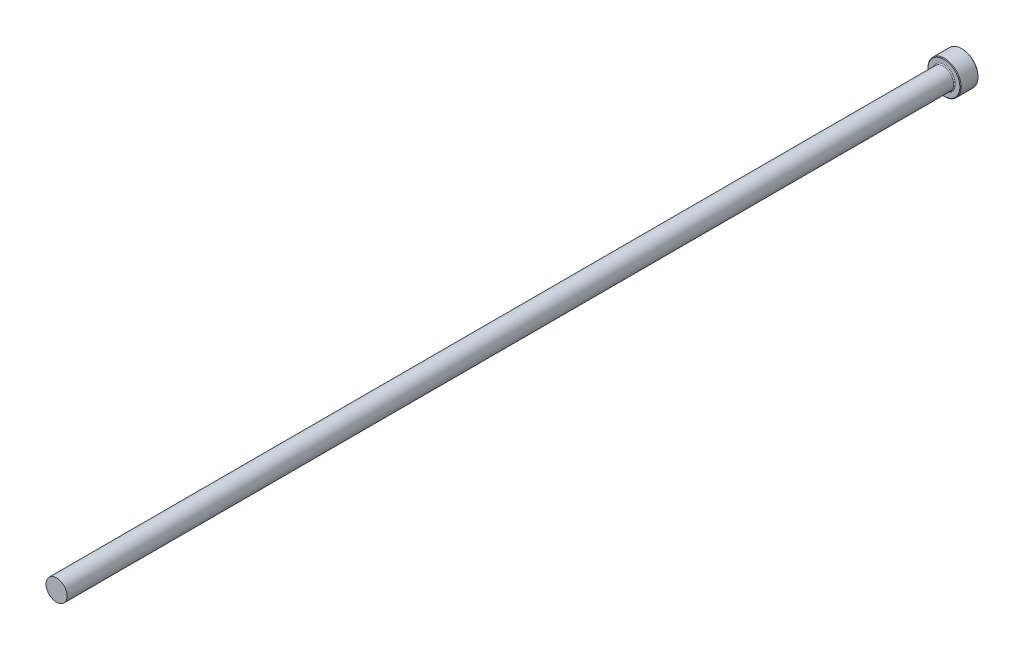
ISO-10303-21;
HEADER;
FILE_DESCRIPTION(('STEP AP214'),'2;1');
FILE_NAME('part.step','',(''),(''),'','','');
FILE_SCHEMA(('AUTOMOTIVE_DESIGN { 1 0 10303 214 1 1 1 1 }'));
ENDSEC;
DATA;
#1=APPLICATION_CONTEXT('core data for automotive mechanical design processes');
#2=APPLICATION_PROTOCOL_DEFINITION('international standard','automotive_design',2000,#1);
#3=PRODUCT_CONTEXT('',#1,'mechanical');
#4=PRODUCT('Part','Part','',(#3));
#5=PRODUCT_RELATED_PRODUCT_CATEGORY('part','',(#4));
#6=PRODUCT_DEFINITION_FORMATION('','',#4);
#7=PRODUCT_DEFINITION_CONTEXT('part definition',#1,'design');
#8=PRODUCT_DEFINITION('design','',#6,#7);
#9=PRODUCT_DEFINITION_SHAPE('','',#8);
#10=(LENGTH_UNIT() NAMED_UNIT(*) SI_UNIT(.MILLI.,.METRE.));
#11=(NAMED_UNIT(*) PLANE_ANGLE_UNIT() SI_UNIT($,.RADIAN.));
#12=(NAMED_UNIT(*) SI_UNIT($,.STERADIAN.) SOLID_ANGLE_UNIT());
#13=UNCERTAINTY_MEASURE_WITH_UNIT(LENGTH_MEASURE(1.E-05),#10,'distance_accuracy_value','');
#14=(GEOMETRIC_REPRESENTATION_CONTEXT(3) GLOBAL_UNCERTAINTY_ASSIGNED_CONTEXT((#13)) GLOBAL_UNIT_ASSIGNED_CONTEXT((#10,
#11,#12)) REPRESENTATION_CONTEXT('',''));
#15=CARTESIAN_POINT('',(0.,0.,0.));
#16=DIRECTION('',(0.,0.,1.));
#17=DIRECTION('',(1.,0.,0.));
#18=AXIS2_PLACEMENT_3D('',#15,#16,#17);
#19=CARTESIAN_POINT('',(0.,3.49999999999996,300.));
#20=DIRECTION('',(0.,0.,-1.));
#21=DIRECTION('',(-1.,0.,0.));
#22=AXIS2_PLACEMENT_3D('',#19,#20,#21);
#23=PLANE('',#22);
#24=CARTESIAN_POINT('',(0.,0.,300.));
#25=DIRECTION('',(0.,0.,1.));
#26=DIRECTION('',(1.,0.,0.));
#27=AXIS2_PLACEMENT_3D('',#24,#25,#26);
#28=CIRCLE('',#27,3.49999999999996);
#29=CARTESIAN_POINT('',(3.49999999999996,0.,300.));
#30=VERTEX_POINT('',#29);
#31=EDGE_CURVE('E50',#30,#30,#28,.T.);
#32=ORIENTED_EDGE('',*,*,#31,.T.);
#33=EDGE_LOOP('',(#32));
#34=FACE_BOUND('',#33,.T.);
#35=ADVANCED_FACE('F30',(#34),#23,.F.);
#36=CARTESIAN_POINT('',(0.,0.,109.050628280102));
#37=DIRECTION('',(0.,0.,1.));
#38=DIRECTION('',(1.,0.,0.));
#39=AXIS2_PLACEMENT_3D('',#36,#37,#38);
#40=CYLINDRICAL_SURFACE('',#39,3.49999999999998);
#41=ORIENTED_EDGE('',*,*,#31,.F.);
#42=EDGE_LOOP('',(#41));
#43=FACE_BOUND('',#42,.T.);
#44=CARTESIAN_POINT('',(0.,0.,6.3));
#45=DIRECTION('',(0.,0.,1.));
#46=DIRECTION('',(1.,0.,0.));
#47=AXIS2_PLACEMENT_3D('',#44,#45,#46);
#48=CIRCLE('',#47,3.5);
#49=CARTESIAN_POINT('',(3.5,0.,6.3));
#50=VERTEX_POINT('',#49);
#51=EDGE_CURVE('E53',#50,#50,#48,.T.);
#52=ORIENTED_EDGE('',*,*,#51,.T.);
#53=EDGE_LOOP('',(#52));
#54=FACE_BOUND('',#53,.T.);
#55=ADVANCED_FACE('F73',(#43,#54),#40,.T.);
#56=CARTESIAN_POINT('',(0.,0.,6.3));
#57=DIRECTION('',(0.,0.,1.));
#58=DIRECTION('',(1.,0.,0.));
#59=AXIS2_PLACEMENT_3D('',#56,#57,#58);
#60=TOROIDAL_SURFACE('',#59,3.8,0.3);
#61=ORIENTED_EDGE('',*,*,#51,.F.);
#62=EDGE_LOOP('',(#61));
#63=FACE_BOUND('',#62,.T.);
#64=CARTESIAN_POINT('',(0.,0.,6.00000000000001));
#65=DIRECTION('',(0.,0.,1.));
#66=DIRECTION('',(1.,0.,0.));
#67=AXIS2_PLACEMENT_3D('',#64,#65,#66);
#68=CIRCLE('',#67,3.8);
#69=CARTESIAN_POINT('',(3.8,0.,6.00000000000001));
#70=VERTEX_POINT('',#69);
#71=EDGE_CURVE('E56',#70,#70,#68,.T.);
#72=ORIENTED_EDGE('',*,*,#71,.T.);
#73=EDGE_LOOP('',(#72));
#74=FACE_BOUND('',#73,.T.);
#75=ADVANCED_FACE('F60',(#63,#74),#60,.F.);
#76=CARTESIAN_POINT('',(0.,5.5,6.));
#77=DIRECTION('',(0.,0.,-1.));
#78=DIRECTION('',(-1.,0.,0.));
#79=AXIS2_PLACEMENT_3D('',#76,#77,#78);
#80=PLANE('',#79);
#81=CARTESIAN_POINT('',(0.,0.,6.));
#82=DIRECTION('',(0.,0.,-1.));
#83=DIRECTION('',(-1.,0.,0.));
#84=AXIS2_PLACEMENT_3D('',#81,#82,#83);
#85=CIRCLE('',#84,5.30000000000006);
#86=CARTESIAN_POINT('',(-5.30000000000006,0.,6.));
#87=VERTEX_POINT('',#86);
#88=EDGE_CURVE('E10',#87,#87,#85,.F.);
#89=ORIENTED_EDGE('',*,*,#88,.T.);
#90=EDGE_LOOP('',(#89));
#91=FACE_BOUND('',#90,.T.);
#92=ORIENTED_EDGE('',*,*,#71,.F.);
#93=EDGE_LOOP('',(#92));
#94=FACE_BOUND('',#93,.T.);
#95=ADVANCED_FACE('F62',(#91,#94),#80,.F.);
#96=CARTESIAN_POINT('',(0.,0.,109.050628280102));
#97=DIRECTION('',(0.,0.,1.));
#98=DIRECTION('',(1.,0.,0.));
#99=AXIS2_PLACEMENT_3D('',#96,#97,#98);
#100=CYLINDRICAL_SURFACE('',#99,5.5);
#101=CARTESIAN_POINT('',(0.,0.,0.200000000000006));
#102=DIRECTION('',(0.,0.,1.));
#103=DIRECTION('',(1.,0.,0.));
#104=AXIS2_PLACEMENT_3D('',#101,#102,#103);
#105=CIRCLE('',#104,5.5);
#106=CARTESIAN_POINT('',(5.5,0.,0.200000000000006));
#107=VERTEX_POINT('',#106);
#108=EDGE_CURVE('E41',#107,#107,#105,.T.);
#109=ORIENTED_EDGE('',*,*,#108,.T.);
#110=EDGE_LOOP('',(#109));
#111=FACE_BOUND('',#110,.T.);
#112=CARTESIAN_POINT('',(0.,0.,5.80000000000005));
#113=DIRECTION('',(0.,0.,-1.));
#114=DIRECTION('',(-1.,0.,0.));
#115=AXIS2_PLACEMENT_3D('',#112,#113,#114);
#116=CIRCLE('',#115,5.5);
#117=CARTESIAN_POINT('',(-5.5,0.,5.80000000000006));
#118=VERTEX_POINT('',#117);
#119=EDGE_CURVE('E45',#118,#118,#116,.T.);
#120=ORIENTED_EDGE('',*,*,#119,.T.);
#121=EDGE_LOOP('',(#120));
#122=FACE_BOUND('',#121,.T.);
#123=ADVANCED_FACE('F64',(#111,#122),#100,.T.);
#124=CARTESIAN_POINT('',(0.,0.,0.));
#125=DIRECTION('',(0.,0.,1.));
#126=DIRECTION('',(1.,0.,0.));
#127=AXIS2_PLACEMENT_3D('',#124,#125,#126);
#128=PLANE('',#127);
#129=CARTESIAN_POINT('',(0.,0.,0.));
#130=DIRECTION('',(0.,0.,1.));
#131=DIRECTION('',(1.,0.,0.));
#132=AXIS2_PLACEMENT_3D('',#129,#130,#131);
#133=CIRCLE('',#132,5.3);
#134=CARTESIAN_POINT('',(5.3,0.,0.));
#135=VERTEX_POINT('',#134);
#136=EDGE_CURVE('E37',#135,#135,#133,.F.);
#137=ORIENTED_EDGE('',*,*,#136,.T.);
#138=EDGE_LOOP('',(#137));
#139=FACE_BOUND('',#138,.T.);
#140=ADVANCED_FACE('F70',(#139),#128,.F.);
#141=CARTESIAN_POINT('',(0.,0.,0.200000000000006));
#142=DIRECTION('',(0.,0.,1.));
#143=DIRECTION('',(1.,0.,0.));
#144=AXIS2_PLACEMENT_3D('',#141,#142,#143);
#145=CONICAL_SURFACE('',#144,5.5,0.785398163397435);
#146=ORIENTED_EDGE('',*,*,#136,.F.);
#147=EDGE_LOOP('',(#146));
#148=FACE_BOUND('',#147,.T.);
#149=ORIENTED_EDGE('',*,*,#108,.F.);
#150=EDGE_LOOP('',(#149));
#151=FACE_BOUND('',#150,.T.);
#152=ADVANCED_FACE('F84',(#148,#151),#145,.T.);
#153=CARTESIAN_POINT('',(0.,0.,6.00000000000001));
#154=DIRECTION('',(0.,0.,-1.));
#155=DIRECTION('',(-1.,0.,0.));
#156=AXIS2_PLACEMENT_3D('',#153,#154,#155);
#157=CONICAL_SURFACE('',#156,5.30000000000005,0.785398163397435);
#158=CARTESIAN_POINT('',(-5.5,0.,5.80000000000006));
#159=CARTESIAN_POINT('',(-5.49791666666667,0.,5.80208333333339));
#160=CARTESIAN_POINT('',(-5.49583333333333,0.,5.80416666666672));
#161=CARTESIAN_POINT('',(-5.49166666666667,0.,5.80833333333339));
#162=CARTESIAN_POINT('',(-5.48958333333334,0.,5.81041666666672));
#163=CARTESIAN_POINT('',(-5.48541666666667,0.,5.81458333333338));
#164=CARTESIAN_POINT('',(-5.48333333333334,0.,5.81666666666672));
#165=CARTESIAN_POINT('',(-5.47916666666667,0.,5.82083333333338));
#166=CARTESIAN_POINT('',(-5.47708333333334,0.,5.82291666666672));
#167=CARTESIAN_POINT('',(-5.47291666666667,0.,5.82708333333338));
#168=CARTESIAN_POINT('',(-5.47083333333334,0.,5.82916666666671));
#169=CARTESIAN_POINT('',(-5.46666666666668,0.,5.83333333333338));
#170=CARTESIAN_POINT('',(-5.46458333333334,0.,5.83541666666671));
#171=CARTESIAN_POINT('',(-5.46041666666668,0.,5.83958333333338));
#172=CARTESIAN_POINT('',(-5.45833333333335,0.,5.84166666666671));
#173=CARTESIAN_POINT('',(-5.45416666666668,0.,5.84583333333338));
#174=CARTESIAN_POINT('',(-5.45208333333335,0.,5.84791666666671));
#175=CARTESIAN_POINT('',(-5.44791666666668,0.,5.85208333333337));
#176=CARTESIAN_POINT('',(-5.44583333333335,0.,5.85416666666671));
#177=CARTESIAN_POINT('',(-5.44166666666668,0.,5.85833333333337));
#178=CARTESIAN_POINT('',(-5.43958333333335,0.,5.86041666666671));
#179=CARTESIAN_POINT('',(-5.43541666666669,0.,5.86458333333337));
#180=CARTESIAN_POINT('',(-5.43333333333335,0.,5.8666666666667));
#181=CARTESIAN_POINT('',(-5.42916666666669,0.,5.87083333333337));
#182=CARTESIAN_POINT('',(-5.42708333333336,0.,5.8729166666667));
#183=CARTESIAN_POINT('',(-5.42291666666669,0.,5.87708333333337));
#184=CARTESIAN_POINT('',(-5.42083333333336,0.,5.8791666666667));
#185=CARTESIAN_POINT('',(-5.41666666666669,0.,5.88333333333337));
#186=CARTESIAN_POINT('',(-5.41458333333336,0.,5.8854166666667));
#187=CARTESIAN_POINT('',(-5.41041666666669,0.,5.88958333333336));
#188=CARTESIAN_POINT('',(-5.40833333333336,0.,5.8916666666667));
#189=CARTESIAN_POINT('',(-5.40416666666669,0.,5.89583333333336));
#190=CARTESIAN_POINT('',(-5.40208333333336,0.,5.8979166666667));
#191=CARTESIAN_POINT('',(-5.3979166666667,0.,5.90208333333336));
#192=CARTESIAN_POINT('',(-5.39583333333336,0.,5.90416666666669));
#193=CARTESIAN_POINT('',(-5.3916666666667,0.,5.90833333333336));
#194=CARTESIAN_POINT('',(-5.38958333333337,0.,5.91041666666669));
#195=CARTESIAN_POINT('',(-5.3854166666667,0.,5.91458333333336));
#196=CARTESIAN_POINT('',(-5.38333333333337,0.,5.91666666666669));
#197=CARTESIAN_POINT('',(-5.3791666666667,0.,5.92083333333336));
#198=CARTESIAN_POINT('',(-5.37708333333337,0.,5.92291666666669));
#199=CARTESIAN_POINT('',(-5.3729166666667,0.,5.92708333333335));
#200=CARTESIAN_POINT('',(-5.37083333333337,0.,5.92916666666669));
#201=CARTESIAN_POINT('',(-5.36666666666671,0.,5.93333333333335));
#202=CARTESIAN_POINT('',(-5.36458333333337,0.,5.93541666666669));
#203=CARTESIAN_POINT('',(-5.36041666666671,0.,5.93958333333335));
#204=CARTESIAN_POINT('',(-5.35833333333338,0.,5.94166666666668));
#205=CARTESIAN_POINT('',(-5.35416666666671,0.,5.94583333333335));
#206=CARTESIAN_POINT('',(-5.35208333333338,0.,5.94791666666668));
#207=CARTESIAN_POINT('',(-5.34791666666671,0.,5.95208333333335));
#208=CARTESIAN_POINT('',(-5.34583333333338,0.,5.95416666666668));
#209=CARTESIAN_POINT('',(-5.34166666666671,0.,5.95833333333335));
#210=CARTESIAN_POINT('',(-5.33958333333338,0.,5.96041666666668));
#211=CARTESIAN_POINT('',(-5.33541666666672,0.,5.96458333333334));
#212=CARTESIAN_POINT('',(-5.33333333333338,0.,5.96666666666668));
#213=CARTESIAN_POINT('',(-5.32916666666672,0.,5.97083333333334));
#214=CARTESIAN_POINT('',(-5.32708333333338,0.,5.97291666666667));
#215=CARTESIAN_POINT('',(-5.32291666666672,0.,5.97708333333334));
#216=CARTESIAN_POINT('',(-5.32083333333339,0.,5.97916666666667));
#217=CARTESIAN_POINT('',(-5.31666666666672,0.,5.98333333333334));
#218=CARTESIAN_POINT('',(-5.31458333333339,0.,5.98541666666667));
#219=CARTESIAN_POINT('',(-5.31041666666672,0.,5.98958333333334));
#220=CARTESIAN_POINT('',(-5.30833333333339,0.,5.99166666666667));
#221=CARTESIAN_POINT('',(-5.30416666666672,0.,5.99583333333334));
#222=CARTESIAN_POINT('',(-5.30208333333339,0.,5.99791666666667));
#223=CARTESIAN_POINT('',(-5.30000000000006,0.,6.));
#224=B_SPLINE_CURVE_WITH_KNOTS('',3,(#158,#159,#160,#161,#162,#163,#164,#165,#166,#167,#168,
#169,#170,#171,#172,#173,#174,#175,#176,#177,#178,#179,#180,#181,#182,#183,#184,#185,#186,#187,
#188,#189,#190,#191,#192,#193,#194,#195,#196,#197,#198,#199,#200,#201,#202,#203,#204,#205,#206,
#207,#208,#209,#210,#211,#212,#213,#214,#215,#216,#217,#218,#219,#220,#221,#222,#223),
.UNSPECIFIED.,.F.,.F.,(4,2,2,2,2,2,2,2,2,2,2,2,2,2,2,2,2,2,2,2,2,2,2,2,2,2,2,2,2,2,2,2,4),(0.,
0.00883883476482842,0.0176776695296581,0.0265165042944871,0.0353553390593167,0.0441941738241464,
0.0530330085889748,0.0618718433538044,0.0707106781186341,0.0795495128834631,0.0883883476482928,
0.0972271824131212,0.106066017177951,0.11490485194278,0.12374368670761,0.132582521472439,
0.141421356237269,0.150260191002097,0.159099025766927,0.167937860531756,0.176776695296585,
0.185615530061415,0.194454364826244,0.203293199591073,0.212132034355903,0.220970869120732,
0.229809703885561,0.23864853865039,0.24748737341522,0.256326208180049,0.265165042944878,
0.274003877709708,0.282842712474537),.UNSPECIFIED.);
#225=EDGE_CURVE('BSEAM32',#118,#87,#224,.T.);
#226=ORIENTED_EDGE('',*,*,#119,.F.);
#227=ORIENTED_EDGE('',*,*,#88,.F.);
#228=ORIENTED_EDGE('',*,*,#225,.T.);
#229=ORIENTED_EDGE('',*,*,#225,.F.);
#230=EDGE_LOOP('',(#226,#228,#227,#229));
#231=FACE_BOUND('',#230,.T.);
#232=ADVANCED_FACE('F32',(#231),#157,.T.);
#233=CLOSED_SHELL('',(#35,#55,#75,#95,#123,#140,#152,#232));
#234=MANIFOLD_SOLID_BREP('B2',#233);
#235=ADVANCED_BREP_SHAPE_REPRESENTATION('',(#18,#234),#14);
#236=SHAPE_DEFINITION_REPRESENTATION(#9,#235);
ENDSEC;
END-ISO-10303-21;
